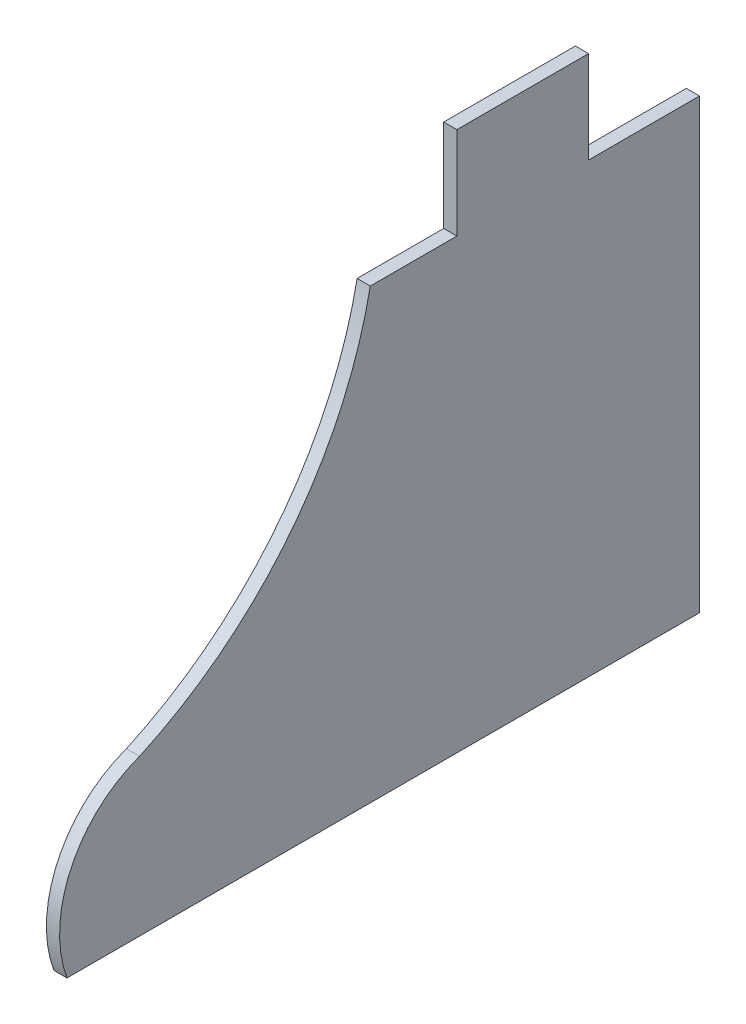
from build123d import *

# Parameters (mm, degrees)
BOSS_EXTRU_1_DEPTH      = 10
ESQUISSE5_R             = 66.434100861
ENL_V_MAT_EXTRU_2_DEPTH = 10


with BuildPart() as part:
    # Esquisse2 → Boss.-Extru.1 (new body)
    with BuildSketch(Plane(origin=(0, 0, 0), x_dir=(0, 0, -1), z_dir=(1, 0, 0))):
        with BuildLine():
            Line((-170.406359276, -768.321686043), (310.083640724, -768.321686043))
            Line((310.083640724, -768.321686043), (310.083640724, -428.321686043))
            Line((310.083640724, -428.321686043), (225.796686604, -428.321686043))
            Line((225.796686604, -428.321686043), (225.796686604, -358.301686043))
            Line((225.796686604, -358.301686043), (125.776686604, -358.301686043))
            Line((125.776686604, -358.301686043), (125.776686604, -428.321686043))
            Line((125.776686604, -428.321686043), (60.001494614, -428.321686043))
            ThreePointArc((60.001494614, -428.321686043), (-0.828816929, -560.36809493), (-115.26976515, -650.033307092))
            ThreePointArc((-115.26976515, -650.033307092), (-167.381214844, -697.737439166), (-170.406359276, -768.321686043))
        make_face()
    extrude(amount=BOSS_EXTRU_1_DEPTH)

    # Esquisse5 → Enl_v. mat.-Extru.2 (cut)
    with BuildSketch(Plane.ZY):
        with Locations((-961.779859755, -372.095858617)):
            Circle(ESQUISSE5_R)
    extrude(amount=-ENL_V_MAT_EXTRU_2_DEPTH, mode=Mode.SUBTRACT)


solid = part.part
